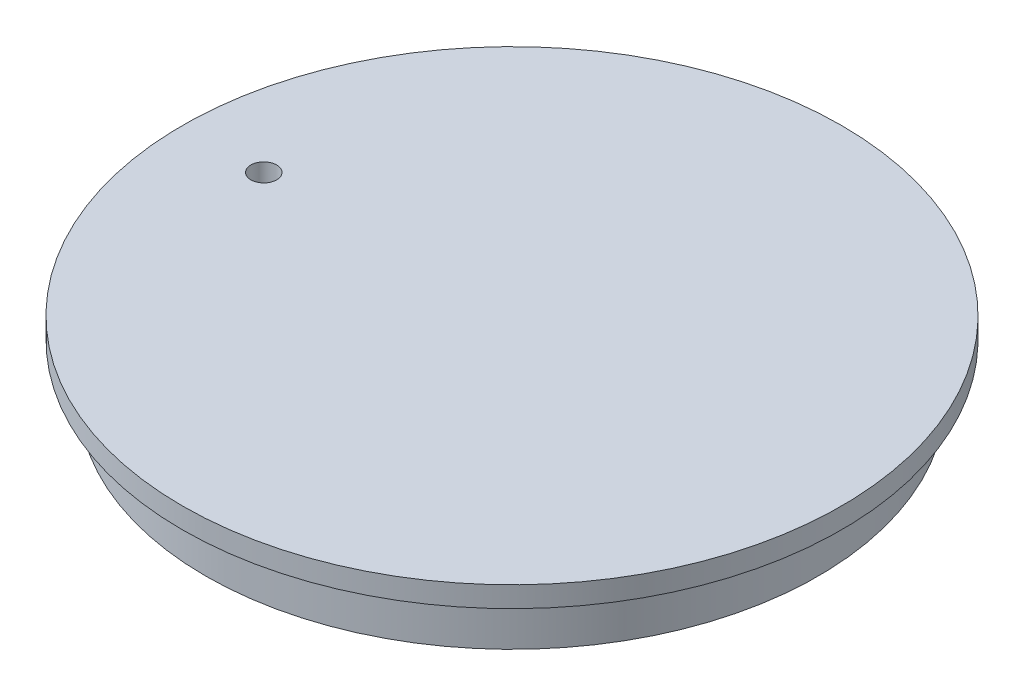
ISO-10303-21;
HEADER;
FILE_DESCRIPTION(('STEP AP214'),'2;1');
FILE_NAME('part.step','',(''),(''),'','','');
FILE_SCHEMA(('AUTOMOTIVE_DESIGN { 1 0 10303 214 1 1 1 1 }'));
ENDSEC;
DATA;
#1=APPLICATION_CONTEXT('core data for automotive mechanical design processes');
#2=APPLICATION_PROTOCOL_DEFINITION('international standard','automotive_design',2000,#1);
#3=PRODUCT_CONTEXT('',#1,'mechanical');
#4=PRODUCT('Part','Part','',(#3));
#5=PRODUCT_RELATED_PRODUCT_CATEGORY('part','',(#4));
#6=PRODUCT_DEFINITION_FORMATION('','',#4);
#7=PRODUCT_DEFINITION_CONTEXT('part definition',#1,'design');
#8=PRODUCT_DEFINITION('design','',#6,#7);
#9=PRODUCT_DEFINITION_SHAPE('','',#8);
#10=(LENGTH_UNIT() NAMED_UNIT(*) SI_UNIT(.MILLI.,.METRE.));
#11=(NAMED_UNIT(*) PLANE_ANGLE_UNIT() SI_UNIT($,.RADIAN.));
#12=(NAMED_UNIT(*) SI_UNIT($,.STERADIAN.) SOLID_ANGLE_UNIT());
#13=UNCERTAINTY_MEASURE_WITH_UNIT(LENGTH_MEASURE(1.E-05),#10,'distance_accuracy_value','');
#14=(GEOMETRIC_REPRESENTATION_CONTEXT(3) GLOBAL_UNCERTAINTY_ASSIGNED_CONTEXT((#13)) GLOBAL_UNIT_ASSIGNED_CONTEXT((#10,
#11,#12)) REPRESENTATION_CONTEXT('',''));
#15=CARTESIAN_POINT('',(0.,0.,0.));
#16=DIRECTION('',(0.,0.,1.));
#17=DIRECTION('',(1.,0.,0.));
#18=AXIS2_PLACEMENT_3D('',#15,#16,#17);
#19=CARTESIAN_POINT('',(0.,0.,0.));
#20=DIRECTION('',(0.,-1.,0.));
#21=DIRECTION('',(0.,0.,-1.));
#22=AXIS2_PLACEMENT_3D('',#19,#20,#21);
#23=PLANE('',#22);
#24=CARTESIAN_POINT('',(-19.20649038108,0.,0.));
#25=DIRECTION('',(0.,1.,0.));
#26=DIRECTION('',(0.,0.,1.));
#27=AXIS2_PLACEMENT_3D('',#24,#25,#26);
#28=CIRCLE('',#27,1.);
#29=CARTESIAN_POINT('',(-19.20649038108,0.,1.));
#30=VERTEX_POINT('',#29);
#31=EDGE_CURVE('E56',#30,#30,#28,.T.);
#32=ORIENTED_EDGE('',*,*,#31,.F.);
#33=EDGE_LOOP('',(#32));
#34=FACE_BOUND('',#33,.T.);
#35=CARTESIAN_POINT('',(0.,0.,0.));
#36=DIRECTION('',(0.,-1.,0.));
#37=DIRECTION('',(0.,0.,-1.));
#38=AXIS2_PLACEMENT_3D('',#35,#36,#37);
#39=CIRCLE('',#38,25.5);
#40=CARTESIAN_POINT('',(0.,0.,-25.5));
#41=VERTEX_POINT('',#40);
#42=EDGE_CURVE('E10',#41,#41,#39,.T.);
#43=ORIENTED_EDGE('',*,*,#42,.F.);
#44=EDGE_LOOP('',(#43));
#45=FACE_BOUND('',#44,.T.);
#46=ADVANCED_FACE('F31',(#34,#45),#23,.F.);
#47=CARTESIAN_POINT('',(0.,-1.6,0.));
#48=DIRECTION('',(0.,-1.,0.));
#49=DIRECTION('',(0.,0.,-1.));
#50=AXIS2_PLACEMENT_3D('',#47,#48,#49);
#51=CYLINDRICAL_SURFACE('',#50,25.5);
#52=CARTESIAN_POINT('',(0.,-1.6,0.));
#53=DIRECTION('',(0.,-1.,0.));
#54=DIRECTION('',(0.,0.,-1.));
#55=AXIS2_PLACEMENT_3D('',#52,#53,#54);
#56=CIRCLE('',#55,25.5);
#57=CARTESIAN_POINT('',(0.,-1.6,-25.5));
#58=VERTEX_POINT('',#57);
#59=EDGE_CURVE('E38',#58,#58,#56,.T.);
#60=ORIENTED_EDGE('',*,*,#59,.F.);
#61=EDGE_LOOP('',(#60));
#62=FACE_BOUND('',#61,.T.);
#63=ORIENTED_EDGE('',*,*,#42,.T.);
#64=EDGE_LOOP('',(#63));
#65=FACE_BOUND('',#64,.T.);
#66=ADVANCED_FACE('F75',(#62,#65),#51,.T.);
#67=CARTESIAN_POINT('',(-25.5,-1.6,0.));
#68=DIRECTION('',(0.,1.,0.));
#69=DIRECTION('',(0.,0.,1.));
#70=AXIS2_PLACEMENT_3D('',#67,#68,#69);
#71=PLANE('',#70);
#72=CARTESIAN_POINT('',(0.,-1.6,0.));
#73=DIRECTION('',(0.,-1.,0.));
#74=DIRECTION('',(0.,0.,-1.));
#75=AXIS2_PLACEMENT_3D('',#72,#73,#74);
#76=CIRCLE('',#75,23.7);
#77=CARTESIAN_POINT('',(0.,-1.6,-23.7));
#78=VERTEX_POINT('',#77);
#79=EDGE_CURVE('E42',#78,#78,#76,.T.);
#80=ORIENTED_EDGE('',*,*,#79,.F.);
#81=EDGE_LOOP('',(#80));
#82=FACE_BOUND('',#81,.T.);
#83=ORIENTED_EDGE('',*,*,#59,.T.);
#84=EDGE_LOOP('',(#83));
#85=FACE_BOUND('',#84,.T.);
#86=ADVANCED_FACE('F80',(#82,#85),#71,.F.);
#87=CARTESIAN_POINT('',(0.,-1.6,0.));
#88=DIRECTION('',(0.,-1.,0.));
#89=DIRECTION('',(0.,0.,-1.));
#90=AXIS2_PLACEMENT_3D('',#87,#88,#89);
#91=CYLINDRICAL_SURFACE('',#90,23.7);
#92=CARTESIAN_POINT('',(0.,-5.6,0.));
#93=DIRECTION('',(0.,-1.,0.));
#94=DIRECTION('',(0.,0.,-1.));
#95=AXIS2_PLACEMENT_3D('',#92,#93,#94);
#96=CIRCLE('',#95,23.7);
#97=CARTESIAN_POINT('',(0.,-5.6,-23.7));
#98=VERTEX_POINT('',#97);
#99=EDGE_CURVE('E47',#98,#98,#96,.T.);
#100=ORIENTED_EDGE('',*,*,#99,.F.);
#101=EDGE_LOOP('',(#100));
#102=FACE_BOUND('',#101,.T.);
#103=ORIENTED_EDGE('',*,*,#79,.T.);
#104=EDGE_LOOP('',(#103));
#105=FACE_BOUND('',#104,.T.);
#106=ADVANCED_FACE('F86',(#102,#105),#91,.T.);
#107=CARTESIAN_POINT('',(-23.7,-5.6,0.));
#108=DIRECTION('',(0.,1.,0.));
#109=DIRECTION('',(0.,0.,1.));
#110=AXIS2_PLACEMENT_3D('',#107,#108,#109);
#111=PLANE('',#110);
#112=CARTESIAN_POINT('',(0.,-5.6,0.));
#113=DIRECTION('',(0.,-1.,0.));
#114=DIRECTION('',(0.,0.,-1.));
#115=AXIS2_PLACEMENT_3D('',#112,#113,#114);
#116=CIRCLE('',#115,22.1);
#117=CARTESIAN_POINT('',(0.,-5.6,-22.1));
#118=VERTEX_POINT('',#117);
#119=EDGE_CURVE('E50',#118,#118,#116,.T.);
#120=ORIENTED_EDGE('',*,*,#119,.F.);
#121=EDGE_LOOP('',(#120));
#122=FACE_BOUND('',#121,.T.);
#123=ORIENTED_EDGE('',*,*,#99,.T.);
#124=EDGE_LOOP('',(#123));
#125=FACE_BOUND('',#124,.T.);
#126=ADVANCED_FACE('F93',(#122,#125),#111,.F.);
#127=CARTESIAN_POINT('',(0.,-5.6,0.));
#128=DIRECTION('',(0.,-1.,0.));
#129=DIRECTION('',(0.,0.,-1.));
#130=AXIS2_PLACEMENT_3D('',#127,#128,#129);
#131=CONICAL_SURFACE('',#130,22.1,0.17453292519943);
#132=CARTESIAN_POINT('',(0.,-1.6,0.));
#133=DIRECTION('',(0.,-1.,0.));
#134=DIRECTION('',(0.,0.,-1.));
#135=AXIS2_PLACEMENT_3D('',#132,#133,#134);
#136=CIRCLE('',#135,21.3946920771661);
#137=CARTESIAN_POINT('',(0.,-1.6,-21.3946920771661));
#138=VERTEX_POINT('',#137);
#139=EDGE_CURVE('E53',#138,#138,#136,.T.);
#140=ORIENTED_EDGE('',*,*,#139,.F.);
#141=EDGE_LOOP('',(#140));
#142=FACE_BOUND('',#141,.T.);
#143=ORIENTED_EDGE('',*,*,#119,.T.);
#144=EDGE_LOOP('',(#143));
#145=FACE_BOUND('',#144,.T.);
#146=ADVANCED_FACE('F72',(#142,#145),#131,.F.);
#147=CARTESIAN_POINT('',(-21.3946920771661,-1.6,0.));
#148=DIRECTION('',(0.,1.,0.));
#149=DIRECTION('',(0.,0.,1.));
#150=AXIS2_PLACEMENT_3D('',#147,#148,#149);
#151=PLANE('',#150);
#152=CARTESIAN_POINT('',(-19.20649038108,-1.6,0.));
#153=DIRECTION('',(0.,1.,0.));
#154=DIRECTION('',(0.,0.,1.));
#155=AXIS2_PLACEMENT_3D('',#152,#153,#154);
#156=CIRCLE('',#155,1.);
#157=CARTESIAN_POINT('',(-19.20649038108,-1.6,1.));
#158=VERTEX_POINT('',#157);
#159=EDGE_CURVE('E34',#158,#158,#156,.T.);
#160=ORIENTED_EDGE('',*,*,#159,.T.);
#161=EDGE_LOOP('',(#160));
#162=FACE_BOUND('',#161,.T.);
#163=ORIENTED_EDGE('',*,*,#139,.T.);
#164=EDGE_LOOP('',(#163));
#165=FACE_BOUND('',#164,.T.);
#166=ADVANCED_FACE('F63',(#162,#165),#151,.F.);
#167=CARTESIAN_POINT('',(-19.20649038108,-5.6,0.));
#168=DIRECTION('',(0.,1.,0.));
#169=DIRECTION('',(0.,0.,1.));
#170=AXIS2_PLACEMENT_3D('',#167,#168,#169);
#171=CYLINDRICAL_SURFACE('',#170,1.);
#172=ORIENTED_EDGE('',*,*,#31,.T.);
#173=EDGE_LOOP('',(#172));
#174=FACE_BOUND('',#173,.T.);
#175=ORIENTED_EDGE('',*,*,#159,.F.);
#176=EDGE_LOOP('',(#175));
#177=FACE_BOUND('',#176,.T.);
#178=ADVANCED_FACE('F66',(#174,#177),#171,.F.);
#179=CLOSED_SHELL('',(#46,#66,#86,#106,#126,#146,#166,#178));
#180=MANIFOLD_SOLID_BREP('B2',#179);
#181=ADVANCED_BREP_SHAPE_REPRESENTATION('',(#18,#180),#14);
#182=SHAPE_DEFINITION_REPRESENTATION(#9,#181);
ENDSEC;
END-ISO-10303-21;
